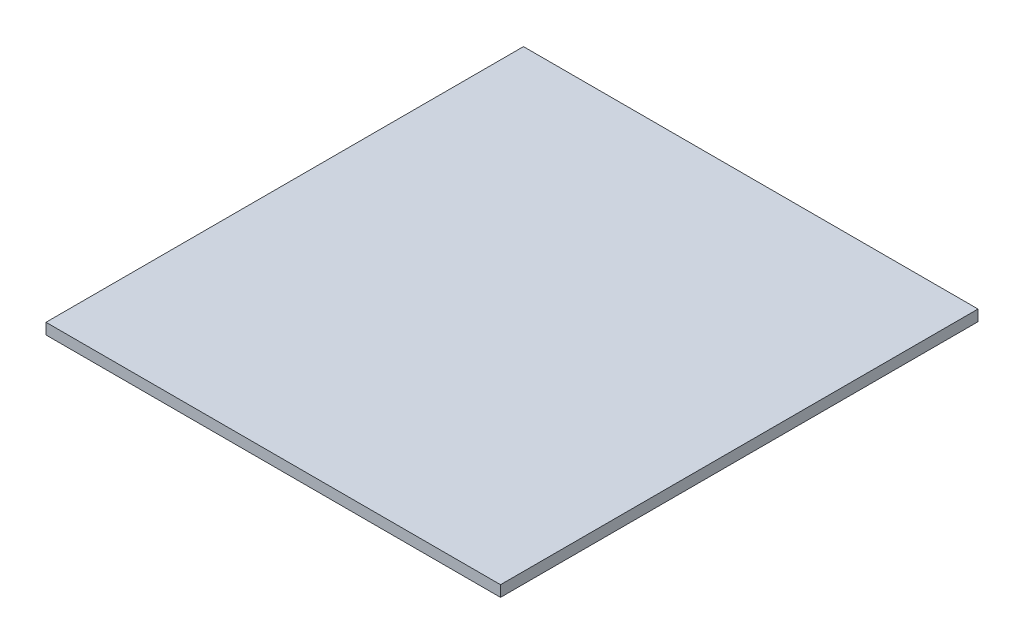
from build123d import *

# Parameters (mm, degrees)
SKETCH1_W           = 495
SKETCH1_H           = 520
BOSS_EXTRUDE1_DEPTH = 12


with BuildPart() as part:
    # Sketch1 → Boss-Extrude1 (new body)
    with BuildSketch(Plane(origin=(0, 0, 0), x_dir=(1, 0, 0), z_dir=(0, 1, 0))):
        Rectangle(SKETCH1_W, SKETCH1_H)
    extrude(amount=BOSS_EXTRUDE1_DEPTH)


solid = part.part
